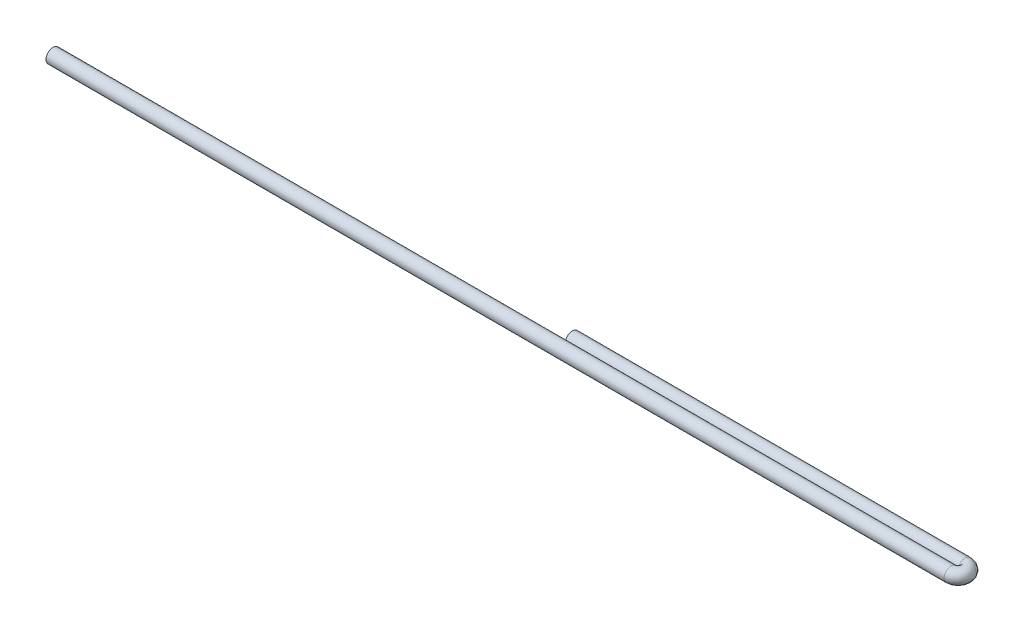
from build123d import *

# Parameters (mm, degrees)
SKETCH2_R = 1.5875


with BuildPart() as part:
    # Sweep1: sweep along a path in Sketch1
    with BuildLine(Plane(origin=(0, 0, 0), x_dir=(1, 0, 0), z_dir=(0, 1, 0))) as sweep1_path:
        Line((0, 0), (203.2, 0))
        ThreePointArc((203.2, 0), (204.7875, 1.5875), (203.2, 3.175))
        Line((203.2, 3.175), (114.3, 3.175))
    # Sketch2 → Sweep1 (sweep)
    with BuildSketch(Plane(origin=(0, 0, 0), x_dir=(0, 0, -1), z_dir=(1, 0, 0))):
        Circle(SKETCH2_R)
    sweep(path=sweep1_path.line)


solid = part.part
